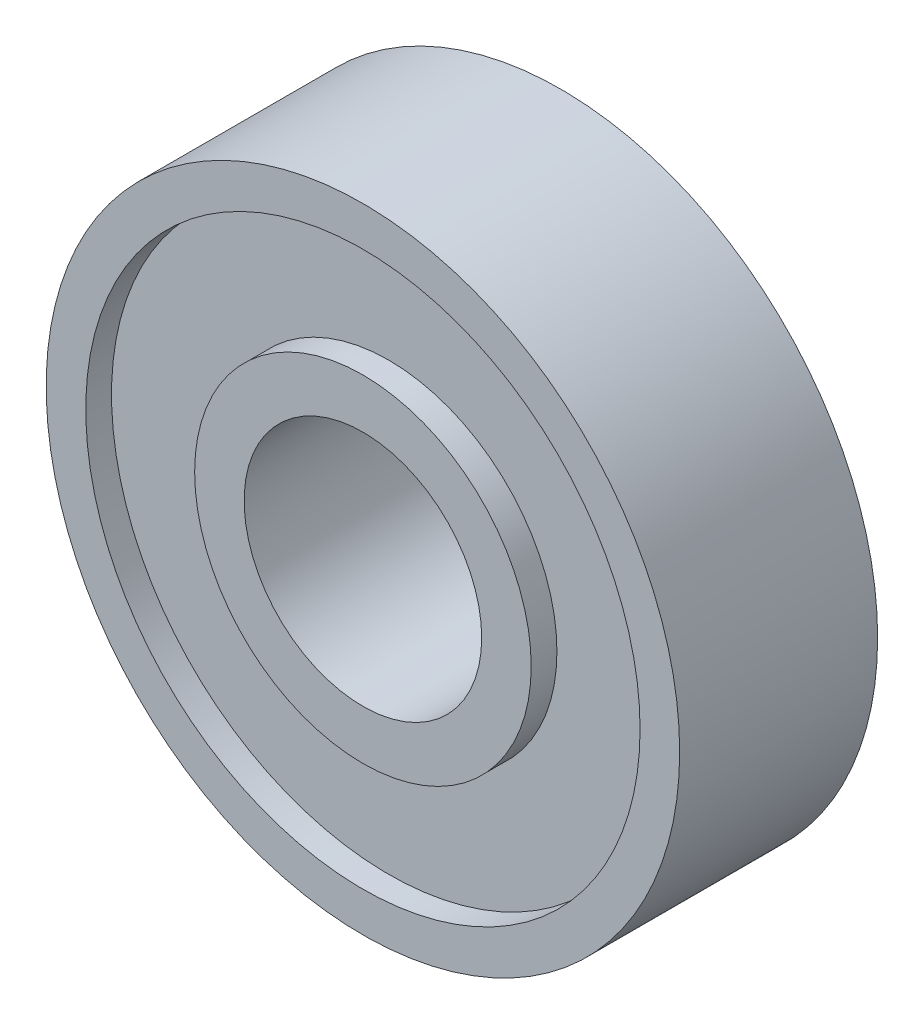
ISO-10303-21;
HEADER;
FILE_DESCRIPTION(('STEP AP214'),'2;1');
FILE_NAME('part.step','',(''),(''),'','','');
FILE_SCHEMA(('AUTOMOTIVE_DESIGN { 1 0 10303 214 1 1 1 1 }'));
ENDSEC;
DATA;
#1=APPLICATION_CONTEXT('core data for automotive mechanical design processes');
#2=APPLICATION_PROTOCOL_DEFINITION('international standard','automotive_design',2000,#1);
#3=PRODUCT_CONTEXT('',#1,'mechanical');
#4=PRODUCT('Part','Part','',(#3));
#5=PRODUCT_RELATED_PRODUCT_CATEGORY('part','',(#4));
#6=PRODUCT_DEFINITION_FORMATION('','',#4);
#7=PRODUCT_DEFINITION_CONTEXT('part definition',#1,'design');
#8=PRODUCT_DEFINITION('design','',#6,#7);
#9=PRODUCT_DEFINITION_SHAPE('','',#8);
#10=(LENGTH_UNIT() NAMED_UNIT(*) SI_UNIT(.MILLI.,.METRE.));
#11=(NAMED_UNIT(*) PLANE_ANGLE_UNIT() SI_UNIT($,.RADIAN.));
#12=(NAMED_UNIT(*) SI_UNIT($,.STERADIAN.) SOLID_ANGLE_UNIT());
#13=UNCERTAINTY_MEASURE_WITH_UNIT(LENGTH_MEASURE(1.E-05),#10,'distance_accuracy_value','');
#14=(GEOMETRIC_REPRESENTATION_CONTEXT(3) GLOBAL_UNCERTAINTY_ASSIGNED_CONTEXT((#13)) GLOBAL_UNIT_ASSIGNED_CONTEXT((#10,
#11,#12)) REPRESENTATION_CONTEXT('',''));
#15=CARTESIAN_POINT('',(0.,0.,0.));
#16=DIRECTION('',(0.,0.,1.));
#17=DIRECTION('',(1.,0.,0.));
#18=AXIS2_PLACEMENT_3D('',#15,#16,#17);
#19=CARTESIAN_POINT('',(0.,0.,0.));
#20=DIRECTION('',(0.,0.,1.));
#21=DIRECTION('',(1.,0.,0.));
#22=AXIS2_PLACEMENT_3D('',#19,#20,#21);
#23=PLANE('',#22);
#24=CARTESIAN_POINT('',(0.,0.,0.));
#25=DIRECTION('',(0.,0.,1.));
#26=DIRECTION('',(1.,0.,0.));
#27=AXIS2_PLACEMENT_3D('',#24,#25,#26);
#28=CIRCLE('',#27,6.);
#29=CARTESIAN_POINT('',(6.,0.,0.));
#30=VERTEX_POINT('',#29);
#31=EDGE_CURVE('E41',#30,#30,#28,.T.);
#32=ORIENTED_EDGE('',*,*,#31,.T.);
#33=EDGE_LOOP('',(#32));
#34=FACE_BOUND('',#33,.T.);
#35=CARTESIAN_POINT('',(0.,0.,0.));
#36=DIRECTION('',(0.,0.,-1.));
#37=DIRECTION('',(-1.,0.,0.));
#38=AXIS2_PLACEMENT_3D('',#35,#36,#37);
#39=CIRCLE('',#38,8.);
#40=CARTESIAN_POINT('',(-8.,0.,0.));
#41=VERTEX_POINT('',#40);
#42=EDGE_CURVE('E65',#41,#41,#39,.T.);
#43=ORIENTED_EDGE('',*,*,#42,.T.);
#44=EDGE_LOOP('',(#43));
#45=FACE_BOUND('',#44,.T.);
#46=ADVANCED_FACE('F28',(#34,#45),#23,.F.);
#47=CARTESIAN_POINT('',(0.,0.,10.));
#48=DIRECTION('',(0.,0.,1.));
#49=DIRECTION('',(1.,0.,0.));
#50=AXIS2_PLACEMENT_3D('',#47,#48,#49);
#51=PLANE('',#50);
#52=CARTESIAN_POINT('',(0.,0.,10.));
#53=DIRECTION('',(0.,0.,1.));
#54=DIRECTION('',(1.,0.,0.));
#55=AXIS2_PLACEMENT_3D('',#52,#53,#54);
#56=CIRCLE('',#55,6.);
#57=CARTESIAN_POINT('',(6.,0.,10.));
#58=VERTEX_POINT('',#57);
#59=EDGE_CURVE('E39',#58,#58,#56,.T.);
#60=ORIENTED_EDGE('',*,*,#59,.F.);
#61=EDGE_LOOP('',(#60));
#62=FACE_BOUND('',#61,.T.);
#63=CARTESIAN_POINT('',(0.,0.,10.));
#64=DIRECTION('',(0.,0.,1.));
#65=DIRECTION('',(1.,0.,0.));
#66=AXIS2_PLACEMENT_3D('',#63,#64,#65);
#67=CIRCLE('',#66,8.5);
#68=CARTESIAN_POINT('',(8.5,0.,10.));
#69=VERTEX_POINT('',#68);
#70=EDGE_CURVE('E53',#69,#69,#67,.T.);
#71=ORIENTED_EDGE('',*,*,#70,.T.);
#72=EDGE_LOOP('',(#71));
#73=FACE_BOUND('',#72,.T.);
#74=ADVANCED_FACE('F103',(#62,#73),#51,.T.);
#75=CARTESIAN_POINT('',(0.,0.,10.));
#76=DIRECTION('',(0.,0.,1.));
#77=DIRECTION('',(1.,0.,0.));
#78=AXIS2_PLACEMENT_3D('',#75,#76,#77);
#79=CIRCLE('',#78,14.);
#80=CARTESIAN_POINT('',(14.,0.,10.));
#81=VERTEX_POINT('',#80);
#82=EDGE_CURVE('E47',#81,#81,#79,.T.);
#83=ORIENTED_EDGE('',*,*,#82,.F.);
#84=EDGE_LOOP('',(#83));
#85=FACE_BOUND('',#84,.T.);
#86=CARTESIAN_POINT('',(0.,0.,10.));
#87=DIRECTION('',(0.,0.,1.));
#88=DIRECTION('',(1.,0.,0.));
#89=AXIS2_PLACEMENT_3D('',#86,#87,#88);
#90=CIRCLE('',#89,16.);
#91=CARTESIAN_POINT('',(16.,0.,10.));
#92=VERTEX_POINT('',#91);
#93=EDGE_CURVE('E10',#92,#92,#90,.T.);
#94=ORIENTED_EDGE('',*,*,#93,.T.);
#95=EDGE_LOOP('',(#94));
#96=FACE_BOUND('',#95,.T.);
#97=ADVANCED_FACE('F90',(#85,#96),#51,.T.);
#98=CARTESIAN_POINT('',(0.,0.,0.));
#99=DIRECTION('',(0.,0.,-1.));
#100=DIRECTION('',(-1.,0.,0.));
#101=AXIS2_PLACEMENT_3D('',#98,#99,#100);
#102=CIRCLE('',#101,12.25);
#103=CARTESIAN_POINT('',(-12.25,0.,0.));
#104=VERTEX_POINT('',#103);
#105=EDGE_CURVE('E59',#104,#104,#102,.T.);
#106=ORIENTED_EDGE('',*,*,#105,.F.);
#107=EDGE_LOOP('',(#106));
#108=FACE_BOUND('',#107,.T.);
#109=CARTESIAN_POINT('',(0.,0.,0.));
#110=DIRECTION('',(0.,0.,1.));
#111=DIRECTION('',(1.,0.,0.));
#112=AXIS2_PLACEMENT_3D('',#109,#110,#111);
#113=CIRCLE('',#112,16.);
#114=CARTESIAN_POINT('',(16.,0.,0.));
#115=VERTEX_POINT('',#114);
#116=EDGE_CURVE('E32',#115,#115,#113,.T.);
#117=ORIENTED_EDGE('',*,*,#116,.F.);
#118=EDGE_LOOP('',(#117));
#119=FACE_BOUND('',#118,.T.);
#120=ADVANCED_FACE('F87',(#108,#119),#23,.F.);
#121=CARTESIAN_POINT('',(0.,0.,10.));
#122=DIRECTION('',(0.,0.,-1.));
#123=DIRECTION('',(-1.,0.,0.));
#124=AXIS2_PLACEMENT_3D('',#121,#122,#123);
#125=CYLINDRICAL_SURFACE('',#124,16.);
#126=ORIENTED_EDGE('',*,*,#93,.F.);
#127=EDGE_LOOP('',(#126));
#128=FACE_BOUND('',#127,.T.);
#129=ORIENTED_EDGE('',*,*,#116,.T.);
#130=EDGE_LOOP('',(#129));
#131=FACE_BOUND('',#130,.T.);
#132=ADVANCED_FACE('F30',(#128,#131),#125,.T.);
#133=CARTESIAN_POINT('',(0.,0.,10.));
#134=DIRECTION('',(0.,0.,-1.));
#135=DIRECTION('',(-1.,0.,0.));
#136=AXIS2_PLACEMENT_3D('',#133,#134,#135);
#137=CYLINDRICAL_SURFACE('',#136,6.);
#138=ORIENTED_EDGE('',*,*,#59,.T.);
#139=EDGE_LOOP('',(#138));
#140=FACE_BOUND('',#139,.T.);
#141=ORIENTED_EDGE('',*,*,#31,.F.);
#142=EDGE_LOOP('',(#141));
#143=FACE_BOUND('',#142,.T.);
#144=ADVANCED_FACE('F94',(#140,#143),#137,.F.);
#145=CARTESIAN_POINT('',(0.,0.,8.7));
#146=DIRECTION('',(0.,0.,1.));
#147=DIRECTION('',(1.,0.,0.));
#148=AXIS2_PLACEMENT_3D('',#145,#146,#147);
#149=CYLINDRICAL_SURFACE('',#148,14.);
#150=CARTESIAN_POINT('',(0.,0.,8.7));
#151=DIRECTION('',(0.,0.,1.));
#152=DIRECTION('',(1.,0.,0.));
#153=AXIS2_PLACEMENT_3D('',#150,#151,#152);
#154=CIRCLE('',#153,14.);
#155=CARTESIAN_POINT('',(14.,0.,8.7));
#156=VERTEX_POINT('',#155);
#157=EDGE_CURVE('E44',#156,#156,#154,.T.);
#158=ORIENTED_EDGE('',*,*,#157,.F.);
#159=EDGE_LOOP('',(#158));
#160=FACE_BOUND('',#159,.T.);
#161=ORIENTED_EDGE('',*,*,#82,.T.);
#162=EDGE_LOOP('',(#161));
#163=FACE_BOUND('',#162,.T.);
#164=ADVANCED_FACE('F99',(#160,#163),#149,.F.);
#165=CARTESIAN_POINT('',(0.,0.,8.7));
#166=DIRECTION('',(0.,0.,1.));
#167=DIRECTION('',(1.,0.,0.));
#168=AXIS2_PLACEMENT_3D('',#165,#166,#167);
#169=PLANE('',#168);
#170=CARTESIAN_POINT('',(0.,0.,8.7));
#171=DIRECTION('',(0.,0.,1.));
#172=DIRECTION('',(1.,0.,0.));
#173=AXIS2_PLACEMENT_3D('',#170,#171,#172);
#174=CIRCLE('',#173,8.5);
#175=CARTESIAN_POINT('',(8.5,0.,8.7));
#176=VERTEX_POINT('',#175);
#177=EDGE_CURVE('E50',#176,#176,#174,.T.);
#178=ORIENTED_EDGE('',*,*,#177,.F.);
#179=EDGE_LOOP('',(#178));
#180=FACE_BOUND('',#179,.T.);
#181=ORIENTED_EDGE('',*,*,#157,.T.);
#182=EDGE_LOOP('',(#181));
#183=FACE_BOUND('',#182,.T.);
#184=ADVANCED_FACE('F116',(#180,#183),#169,.T.);
#185=CARTESIAN_POINT('',(0.,0.,8.7));
#186=DIRECTION('',(0.,0.,1.));
#187=DIRECTION('',(1.,0.,0.));
#188=AXIS2_PLACEMENT_3D('',#185,#186,#187);
#189=CYLINDRICAL_SURFACE('',#188,8.5);
#190=ORIENTED_EDGE('',*,*,#177,.T.);
#191=EDGE_LOOP('',(#190));
#192=FACE_BOUND('',#191,.T.);
#193=ORIENTED_EDGE('',*,*,#70,.F.);
#194=EDGE_LOOP('',(#193));
#195=FACE_BOUND('',#194,.T.);
#196=ADVANCED_FACE('F83',(#192,#195),#189,.T.);
#197=CARTESIAN_POINT('',(0.,0.,1.8));
#198=DIRECTION('',(0.,0.,-1.));
#199=DIRECTION('',(-1.,0.,0.));
#200=AXIS2_PLACEMENT_3D('',#197,#198,#199);
#201=CYLINDRICAL_SURFACE('',#200,12.25);
#202=CARTESIAN_POINT('',(0.,0.,1.8));
#203=DIRECTION('',(0.,0.,-1.));
#204=DIRECTION('',(-1.,0.,0.));
#205=AXIS2_PLACEMENT_3D('',#202,#203,#204);
#206=CIRCLE('',#205,12.25);
#207=CARTESIAN_POINT('',(-12.25,0.,1.8));
#208=VERTEX_POINT('',#207);
#209=EDGE_CURVE('E56',#208,#208,#206,.T.);
#210=ORIENTED_EDGE('',*,*,#209,.F.);
#211=EDGE_LOOP('',(#210));
#212=FACE_BOUND('',#211,.T.);
#213=ORIENTED_EDGE('',*,*,#105,.T.);
#214=EDGE_LOOP('',(#213));
#215=FACE_BOUND('',#214,.T.);
#216=ADVANCED_FACE('F77',(#212,#215),#201,.F.);
#217=CARTESIAN_POINT('',(0.,0.,1.8));
#218=DIRECTION('',(0.,0.,-1.));
#219=DIRECTION('',(-1.,0.,0.));
#220=AXIS2_PLACEMENT_3D('',#217,#218,#219);
#221=PLANE('',#220);
#222=CARTESIAN_POINT('',(0.,0.,1.8));
#223=DIRECTION('',(0.,0.,-1.));
#224=DIRECTION('',(-1.,0.,0.));
#225=AXIS2_PLACEMENT_3D('',#222,#223,#224);
#226=CIRCLE('',#225,8.);
#227=CARTESIAN_POINT('',(-8.,0.,1.8));
#228=VERTEX_POINT('',#227);
#229=EDGE_CURVE('E62',#228,#228,#226,.T.);
#230=ORIENTED_EDGE('',*,*,#229,.F.);
#231=EDGE_LOOP('',(#230));
#232=FACE_BOUND('',#231,.T.);
#233=ORIENTED_EDGE('',*,*,#209,.T.);
#234=EDGE_LOOP('',(#233));
#235=FACE_BOUND('',#234,.T.);
#236=ADVANCED_FACE('F74',(#232,#235),#221,.T.);
#237=CARTESIAN_POINT('',(0.,0.,1.8));
#238=DIRECTION('',(0.,0.,-1.));
#239=DIRECTION('',(-1.,0.,0.));
#240=AXIS2_PLACEMENT_3D('',#237,#238,#239);
#241=CYLINDRICAL_SURFACE('',#240,8.);
#242=ORIENTED_EDGE('',*,*,#229,.T.);
#243=EDGE_LOOP('',(#242));
#244=FACE_BOUND('',#243,.T.);
#245=ORIENTED_EDGE('',*,*,#42,.F.);
#246=EDGE_LOOP('',(#245));
#247=FACE_BOUND('',#246,.T.);
#248=ADVANCED_FACE('F71',(#244,#247),#241,.T.);
#249=CLOSED_SHELL('',(#46,#74,#97,#120,#132,#144,#164,#184,#196,#216,#236,#248));
#250=MANIFOLD_SOLID_BREP('B2',#249);
#251=ADVANCED_BREP_SHAPE_REPRESENTATION('',(#18,#250),#14);
#252=SHAPE_DEFINITION_REPRESENTATION(#9,#251);
ENDSEC;
END-ISO-10303-21;
